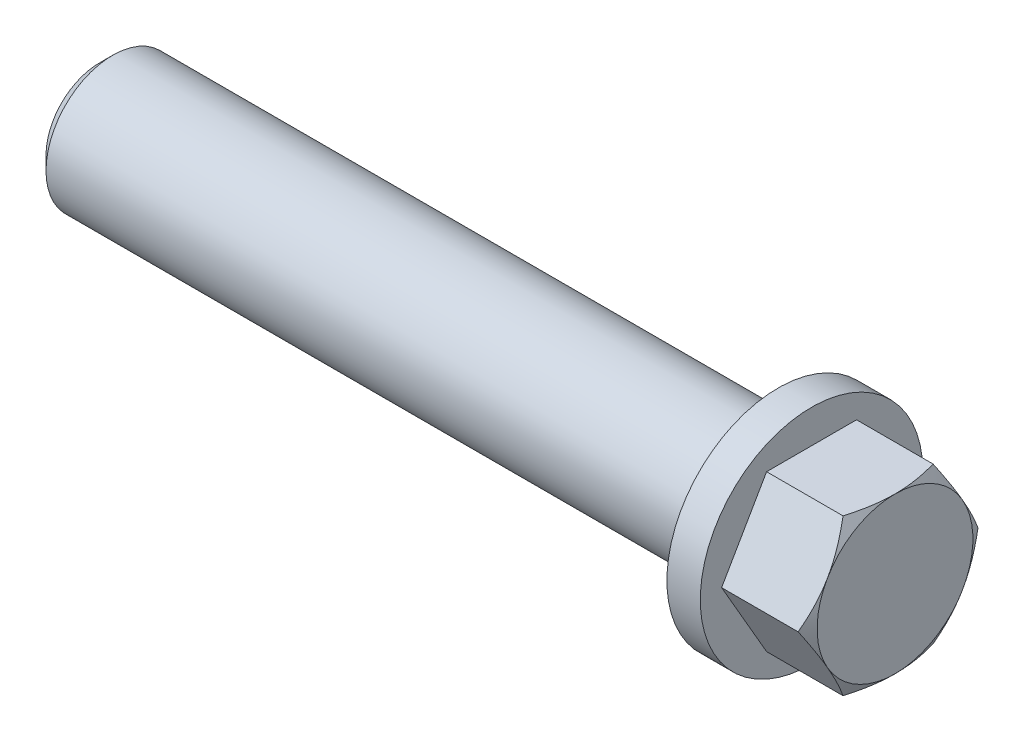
from build123d import *

# Parameters (mm, degrees)
BASE_EXTRUSION_DEPTH = 7.5
ESQUISSE2_R          = 6
BOSS_EXTRU_1_DEPTH   = 64
CHANFREIN1_SIZE      = 1.2
ESQUISSE4_W          = 3
ESQUISSE4_H          = 10
ESQUISSE5_W          = 34
ESQUISSE5_H          = 6


with BuildPart() as part:
    # Esquisse1 → Base-Extrusion (new body)
    with BuildSketch(Plane(origin=(0, 0, 0), x_dir=(0, 0, -1), z_dir=(1, 0, 0))):
        Polygon((8.082903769, 0), (4.041451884, 7), (-4.041451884, 7), (-8.082903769, 0), (-4.041451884, -7), (4.041451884, -7), align=None)
    extrude(amount=BASE_EXTRUSION_DEPTH)

    # Esquisse2 → Boss.-Extru.1 (add)
    with BuildSketch(Plane.ZY):
        Circle(ESQUISSE2_R)
    extrude(amount=BOSS_EXTRU_1_DEPTH)

    # Esquisse3 → Enl_vement de mati_re-R_volution1 (revolve, cut)
    with BuildSketch(Plane.XY):
        Polygon((7.5, -7), (0, -19.990381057), (7.5, -19.990381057), align=None)
    revolve(axis=Axis((0, 0, 0), (1, 0, 0)), mode=Mode.SUBTRACT)

    # Chanfrein1
    chanfrein1_edges = [part.edges().sort_by_distance(p)[0] for p in [
        (-64, 0, -6),
    ]]
    chamfer(chanfrein1_edges, length=CHANFREIN1_SIZE)

    # Esquisse4 → R_volution1 (revolve)
    with BuildSketch(Plane.XY, mode=Mode.PRIVATE) as r_volution1_sk:
        with Locations((-1.5, 5)):
            Rectangle(ESQUISSE4_W, ESQUISSE4_H)
    revolve(r_volution1_sk.sketch.rotate(Axis((0, 0, 0), (-1, 0, 0)), 90), axis=Axis((0, 0, 0), (-1, 0, 0)))

    # Esquisse5 → R_volution2 (revolve)
    with BuildSketch(Plane.XY):
        with Locations((-20, 3)):
            Rectangle(ESQUISSE5_W, ESQUISSE5_H)
    revolve(axis=Axis((0, 0, 0), (-1, 0, 0)))


solid = part.part
